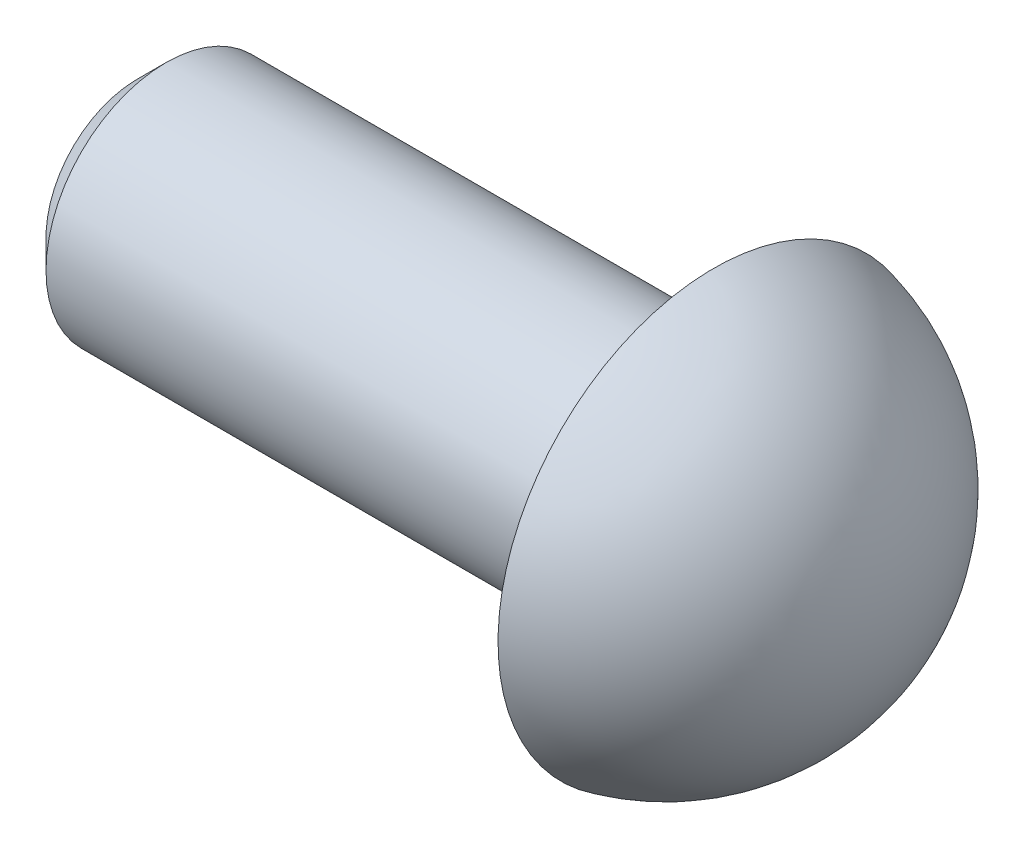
ISO-10303-21;
HEADER;
FILE_DESCRIPTION(('STEP AP214'),'2;1');
FILE_NAME('part.step','',(''),(''),'','','');
FILE_SCHEMA(('AUTOMOTIVE_DESIGN { 1 0 10303 214 1 1 1 1 }'));
ENDSEC;
DATA;
#1=APPLICATION_CONTEXT('core data for automotive mechanical design processes');
#2=APPLICATION_PROTOCOL_DEFINITION('international standard','automotive_design',2000,#1);
#3=PRODUCT_CONTEXT('',#1,'mechanical');
#4=PRODUCT('Part','Part','',(#3));
#5=PRODUCT_RELATED_PRODUCT_CATEGORY('part','',(#4));
#6=PRODUCT_DEFINITION_FORMATION('','',#4);
#7=PRODUCT_DEFINITION_CONTEXT('part definition',#1,'design');
#8=PRODUCT_DEFINITION('design','',#6,#7);
#9=PRODUCT_DEFINITION_SHAPE('','',#8);
#10=(LENGTH_UNIT() NAMED_UNIT(*) SI_UNIT(.MILLI.,.METRE.));
#11=(NAMED_UNIT(*) PLANE_ANGLE_UNIT() SI_UNIT($,.RADIAN.));
#12=(NAMED_UNIT(*) SI_UNIT($,.STERADIAN.) SOLID_ANGLE_UNIT());
#13=UNCERTAINTY_MEASURE_WITH_UNIT(LENGTH_MEASURE(1.E-05),#10,'distance_accuracy_value','');
#14=(GEOMETRIC_REPRESENTATION_CONTEXT(3) GLOBAL_UNCERTAINTY_ASSIGNED_CONTEXT((#13)) GLOBAL_UNIT_ASSIGNED_CONTEXT((#10,
#11,#12)) REPRESENTATION_CONTEXT('',''));
#15=CARTESIAN_POINT('',(0.,0.,0.));
#16=DIRECTION('',(0.,0.,1.));
#17=DIRECTION('',(1.,0.,0.));
#18=AXIS2_PLACEMENT_3D('',#15,#16,#17);
#19=CARTESIAN_POINT('',(-0.499999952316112,-2.22610744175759E-13,0.));
#20=DIRECTION('',(1.,0.,0.));
#21=DIRECTION('',(0.,-1.,0.));
#22=AXIS2_PLACEMENT_3D('',#19,#20,#21);
#23=SPHERICAL_SURFACE('',#22,2.29999995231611);
#24=CARTESIAN_POINT('',(0.,0.,0.));
#25=DIRECTION('',(1.,0.,0.));
#26=DIRECTION('',(0.,0.,-1.));
#27=AXIS2_PLACEMENT_3D('',#24,#25,#26);
#28=CIRCLE('',#27,2.24499439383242);
#29=CARTESIAN_POINT('',(0.,0.,-2.24499439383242));
#30=VERTEX_POINT('',#29);
#31=EDGE_CURVE('E45',#30,#30,#28,.T.);
#32=ORIENTED_EDGE('',*,*,#31,.T.);
#33=EDGE_LOOP('',(#32));
#34=FACE_BOUND('',#33,.T.);
#35=ADVANCED_FACE('F30',(#34),#23,.T.);
#36=CARTESIAN_POINT('',(-6.,-1.24999999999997,0.));
#37=DIRECTION('',(1.,0.,0.));
#38=DIRECTION('',(0.,0.,-1.));
#39=AXIS2_PLACEMENT_3D('',#36,#37,#38);
#40=PLANE('',#39);
#41=CARTESIAN_POINT('',(-6.,0.,0.));
#42=DIRECTION('',(1.,0.,0.));
#43=DIRECTION('',(0.,0.,-1.));
#44=AXIS2_PLACEMENT_3D('',#41,#42,#43);
#45=CIRCLE('',#44,0.949999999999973);
#46=CARTESIAN_POINT('',(-6.,0.,-0.949999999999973));
#47=VERTEX_POINT('',#46);
#48=EDGE_CURVE('E10',#47,#47,#45,.F.);
#49=ORIENTED_EDGE('',*,*,#48,.T.);
#50=EDGE_LOOP('',(#49));
#51=FACE_BOUND('',#50,.T.);
#52=ADVANCED_FACE('F60',(#51),#40,.F.);
#53=CARTESIAN_POINT('',(1.82303058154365,0.,0.));
#54=DIRECTION('',(1.,0.,0.));
#55=DIRECTION('',(0.,0.,-1.));
#56=AXIS2_PLACEMENT_3D('',#53,#54,#55);
#57=CYLINDRICAL_SURFACE('',#56,1.24999999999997);
#58=CARTESIAN_POINT('',(-5.7,0.,0.));
#59=DIRECTION('',(1.,0.,0.));
#60=DIRECTION('',(0.,0.,-1.));
#61=AXIS2_PLACEMENT_3D('',#58,#59,#60);
#62=CIRCLE('',#61,1.24999999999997);
#63=CARTESIAN_POINT('',(-5.7,0.,-1.24999999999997));
#64=VERTEX_POINT('',#63);
#65=EDGE_CURVE('E37',#64,#64,#62,.T.);
#66=ORIENTED_EDGE('',*,*,#65,.T.);
#67=EDGE_LOOP('',(#66));
#68=FACE_BOUND('',#67,.T.);
#69=CARTESIAN_POINT('',(0.,0.,0.));
#70=DIRECTION('',(1.,0.,0.));
#71=DIRECTION('',(0.,0.,-1.));
#72=AXIS2_PLACEMENT_3D('',#69,#70,#71);
#73=CIRCLE('',#72,1.24999999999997);
#74=CARTESIAN_POINT('',(0.,0.,-1.24999999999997));
#75=VERTEX_POINT('',#74);
#76=EDGE_CURVE('E41',#75,#75,#73,.T.);
#77=ORIENTED_EDGE('',*,*,#76,.F.);
#78=EDGE_LOOP('',(#77));
#79=FACE_BOUND('',#78,.T.);
#80=ADVANCED_FACE('F55',(#68,#79),#57,.T.);
#81=CARTESIAN_POINT('',(0.,-2.24499439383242,0.));
#82=DIRECTION('',(1.,0.,0.));
#83=DIRECTION('',(0.,0.,-1.));
#84=AXIS2_PLACEMENT_3D('',#81,#82,#83);
#85=PLANE('',#84);
#86=ORIENTED_EDGE('',*,*,#31,.F.);
#87=EDGE_LOOP('',(#86));
#88=FACE_BOUND('',#87,.T.);
#89=ORIENTED_EDGE('',*,*,#76,.T.);
#90=EDGE_LOOP('',(#89));
#91=FACE_BOUND('',#90,.T.);
#92=ADVANCED_FACE('F52',(#88,#91),#85,.F.);
#93=CARTESIAN_POINT('',(-5.7,0.,0.));
#94=DIRECTION('',(1.,0.,0.));
#95=DIRECTION('',(0.,0.,-1.));
#96=AXIS2_PLACEMENT_3D('',#93,#94,#95);
#97=CONICAL_SURFACE('',#96,1.24999999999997,0.78539816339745);
#98=ORIENTED_EDGE('',*,*,#48,.F.);
#99=EDGE_LOOP('',(#98));
#100=FACE_BOUND('',#99,.T.);
#101=ORIENTED_EDGE('',*,*,#65,.F.);
#102=EDGE_LOOP('',(#101));
#103=FACE_BOUND('',#102,.T.);
#104=ADVANCED_FACE('F32',(#100,#103),#97,.T.);
#105=CLOSED_SHELL('',(#35,#52,#80,#92,#104));
#106=MANIFOLD_SOLID_BREP('B2',#105);
#107=ADVANCED_BREP_SHAPE_REPRESENTATION('',(#18,#106),#14);
#108=SHAPE_DEFINITION_REPRESENTATION(#9,#107);
ENDSEC;
END-ISO-10303-21;
